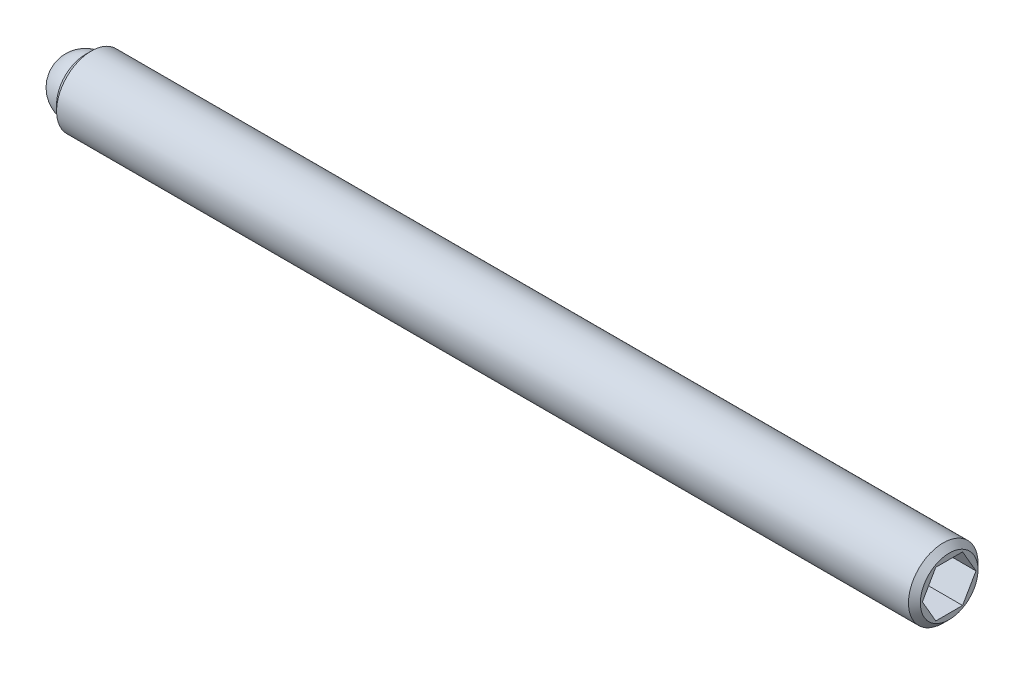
ISO-10303-21;
HEADER;
FILE_DESCRIPTION(('STEP AP214'),'2;1');
FILE_NAME('part.step','',(''),(''),'','','');
FILE_SCHEMA(('AUTOMOTIVE_DESIGN { 1 0 10303 214 1 1 1 1 }'));
ENDSEC;
DATA;
#1=APPLICATION_CONTEXT('core data for automotive mechanical design processes');
#2=APPLICATION_PROTOCOL_DEFINITION('international standard','automotive_design',2000,#1);
#3=PRODUCT_CONTEXT('',#1,'mechanical');
#4=PRODUCT('Part','Part','',(#3));
#5=PRODUCT_RELATED_PRODUCT_CATEGORY('part','',(#4));
#6=PRODUCT_DEFINITION_FORMATION('','',#4);
#7=PRODUCT_DEFINITION_CONTEXT('part definition',#1,'design');
#8=PRODUCT_DEFINITION('design','',#6,#7);
#9=PRODUCT_DEFINITION_SHAPE('','',#8);
#10=(LENGTH_UNIT() NAMED_UNIT(*) SI_UNIT(.MILLI.,.METRE.));
#11=(NAMED_UNIT(*) PLANE_ANGLE_UNIT() SI_UNIT($,.RADIAN.));
#12=(NAMED_UNIT(*) SI_UNIT($,.STERADIAN.) SOLID_ANGLE_UNIT());
#13=UNCERTAINTY_MEASURE_WITH_UNIT(LENGTH_MEASURE(1.E-05),#10,'distance_accuracy_value','');
#14=(GEOMETRIC_REPRESENTATION_CONTEXT(3) GLOBAL_UNCERTAINTY_ASSIGNED_CONTEXT((#13)) GLOBAL_UNIT_ASSIGNED_CONTEXT((#10,
#11,#12)) REPRESENTATION_CONTEXT('',''));
#15=CARTESIAN_POINT('',(0.,0.,0.));
#16=DIRECTION('',(0.,0.,1.));
#17=DIRECTION('',(1.,0.,0.));
#18=AXIS2_PLACEMENT_3D('',#15,#16,#17);
#19=CARTESIAN_POINT('',(0.,0.,0.));
#20=DIRECTION('',(0.,-1.,0.));
#21=DIRECTION('',(0.,0.,-1.));
#22=AXIS2_PLACEMENT_3D('',#19,#20,#21);
#23=SPHERICAL_SURFACE('',#22,1.190625);
#24=CARTESIAN_POINT('',(0.,-1.190625,0.));
#25=VERTEX_POINT('',#24);
#26=VERTEX_LOOP('',#25);
#27=FACE_BOUND('',#26,.T.);
#28=ADVANCED_FACE('F43',(#27),#23,.T.);
#29=CLOSED_SHELL('',(#28));
#30=MANIFOLD_SOLID_BREP('B2',#29);
#31=CARTESIAN_POINT('',(36.909375,0.,0.));
#32=DIRECTION('',(-1.,0.,0.));
#33=DIRECTION('',(0.,0.,1.));
#34=AXIS2_PLACEMENT_3D('',#31,#32,#33);
#35=CYLINDRICAL_SURFACE('',#34,1.4859);
#36=CARTESIAN_POINT('',(36.655375,0.,0.));
#37=DIRECTION('',(1.,0.,0.));
#38=DIRECTION('',(0.,0.,-1.));
#39=AXIS2_PLACEMENT_3D('',#36,#37,#38);
#40=CIRCLE('',#39,1.4859);
#41=CARTESIAN_POINT('',(36.655375,0.,-1.4859));
#42=VERTEX_POINT('',#41);
#43=EDGE_CURVE('E41',#42,#42,#40,.F.);
#44=ORIENTED_EDGE('',*,*,#43,.T.);
#45=EDGE_LOOP('',(#44));
#46=FACE_BOUND('',#45,.T.);
#47=CARTESIAN_POINT('',(0.253999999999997,0.,0.));
#48=DIRECTION('',(1.,0.,0.));
#49=DIRECTION('',(0.,0.,-1.));
#50=AXIS2_PLACEMENT_3D('',#47,#48,#49);
#51=CIRCLE('',#50,1.4859);
#52=CARTESIAN_POINT('',(0.253999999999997,0.,-1.4859));
#53=VERTEX_POINT('',#52);
#54=EDGE_CURVE('E159',#53,#53,#51,.T.);
#55=ORIENTED_EDGE('',*,*,#54,.T.);
#56=EDGE_LOOP('',(#55));
#57=FACE_BOUND('',#56,.T.);
#58=ADVANCED_FACE('F56',(#46,#57),#35,.T.);
#59=CARTESIAN_POINT('',(36.909375,0.,0.));
#60=DIRECTION('',(1.,0.,0.));
#61=DIRECTION('',(0.,0.,-1.));
#62=AXIS2_PLACEMENT_3D('',#59,#60,#61);
#63=PLANE('',#62);
#64=DIRECTION('',(0.,0.866025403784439,-0.5));
#65=VECTOR('',#64,1.);
#66=CARTESIAN_POINT('',(36.909375,-0.992187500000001,-0.572839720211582));
#67=LINE('',#66,#65);
#68=CARTESIAN_POINT('',(36.909375,-0.992187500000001,-0.572839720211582));
#69=VERTEX_POINT('',#68);
#70=CARTESIAN_POINT('',(36.909375,0.,-1.14567944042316));
#71=VERTEX_POINT('',#70);
#72=EDGE_CURVE('E71',#69,#71,#67,.T.);
#73=ORIENTED_EDGE('',*,*,#72,.F.);
#74=DIRECTION('',(0.,0.,-1.));
#75=VECTOR('',#74,1.);
#76=CARTESIAN_POINT('',(36.909375,-0.992187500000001,0.572839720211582));
#77=LINE('',#76,#75);
#78=CARTESIAN_POINT('',(36.909375,-0.992187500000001,0.572839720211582));
#79=VERTEX_POINT('',#78);
#80=EDGE_CURVE('E155',#79,#69,#77,.T.);
#81=ORIENTED_EDGE('',*,*,#80,.F.);
#82=DIRECTION('',(0.,-0.866025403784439,-0.5));
#83=VECTOR('',#82,1.);
#84=CARTESIAN_POINT('',(36.909375,0.,1.14567944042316));
#85=LINE('',#84,#83);
#86=CARTESIAN_POINT('',(36.909375,0.,1.14567944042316));
#87=VERTEX_POINT('',#86);
#88=EDGE_CURVE('E153',#87,#79,#85,.T.);
#89=ORIENTED_EDGE('',*,*,#88,.F.);
#90=DIRECTION('',(0.,-0.866025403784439,0.5));
#91=VECTOR('',#90,1.);
#92=CARTESIAN_POINT('',(36.909375,0.992187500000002,0.572839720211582));
#93=LINE('',#92,#91);
#94=CARTESIAN_POINT('',(36.909375,0.992187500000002,0.572839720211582));
#95=VERTEX_POINT('',#94);
#96=EDGE_CURVE('E119',#95,#87,#93,.T.);
#97=ORIENTED_EDGE('',*,*,#96,.F.);
#98=DIRECTION('',(0.,0.,1.));
#99=VECTOR('',#98,1.);
#100=CARTESIAN_POINT('',(36.909375,0.992187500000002,-0.572839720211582));
#101=LINE('',#100,#99);
#102=CARTESIAN_POINT('',(36.909375,0.992187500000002,-0.572839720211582));
#103=VERTEX_POINT('',#102);
#104=EDGE_CURVE('E149',#103,#95,#101,.T.);
#105=ORIENTED_EDGE('',*,*,#104,.F.);
#106=DIRECTION('',(0.,0.866025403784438,0.5));
#107=VECTOR('',#106,1.);
#108=CARTESIAN_POINT('',(36.909375,0.,-1.14567944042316));
#109=LINE('',#108,#107);
#110=EDGE_CURVE('E145',#71,#103,#109,.T.);
#111=ORIENTED_EDGE('',*,*,#110,.F.);
#112=EDGE_LOOP('',(#73,#81,#89,#97,#105,#111));
#113=FACE_BOUND('',#112,.T.);
#114=CARTESIAN_POINT('',(36.909375,0.,0.));
#115=DIRECTION('',(1.,0.,0.));
#116=DIRECTION('',(0.,0.,-1.));
#117=AXIS2_PLACEMENT_3D('',#114,#115,#116);
#118=CIRCLE('',#117,1.23190000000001);
#119=CARTESIAN_POINT('',(36.909375,0.,-1.23190000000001));
#120=VERTEX_POINT('',#119);
#121=EDGE_CURVE('E64',#120,#120,#118,.T.);
#122=ORIENTED_EDGE('',*,*,#121,.T.);
#123=EDGE_LOOP('',(#122));
#124=FACE_BOUND('',#123,.T.);
#125=ADVANCED_FACE('F172',(#113,#124),#63,.T.);
#126=CARTESIAN_POINT('',(0.,0.,0.));
#127=DIRECTION('',(1.,0.,0.));
#128=DIRECTION('',(0.,0.,-1.));
#129=AXIS2_PLACEMENT_3D('',#126,#127,#128);
#130=PLANE('',#129);
#131=CARTESIAN_POINT('',(0.,0.,0.));
#132=DIRECTION('',(-1.,0.,0.));
#133=DIRECTION('',(0.,0.,1.));
#134=AXIS2_PLACEMENT_3D('',#131,#132,#133);
#135=CIRCLE('',#134,1.190625);
#136=CARTESIAN_POINT('',(0.,0.,1.190625));
#137=VERTEX_POINT('',#136);
#138=EDGE_CURVE('E227',#137,#137,#135,.T.);
#139=ORIENTED_EDGE('',*,*,#138,.F.);
#140=EDGE_LOOP('',(#139));
#141=FACE_BOUND('',#140,.T.);
#142=CARTESIAN_POINT('',(0.,0.,0.));
#143=DIRECTION('',(1.,0.,0.));
#144=DIRECTION('',(0.,0.,-1.));
#145=AXIS2_PLACEMENT_3D('',#142,#143,#144);
#146=CIRCLE('',#145,1.2319);
#147=CARTESIAN_POINT('',(0.,0.,-1.2319));
#148=VERTEX_POINT('',#147);
#149=EDGE_CURVE('E167',#148,#148,#146,.F.);
#150=ORIENTED_EDGE('',*,*,#149,.T.);
#151=EDGE_LOOP('',(#150));
#152=FACE_BOUND('',#151,.T.);
#153=ADVANCED_FACE('F184',(#141,#152),#130,.F.);
#154=CARTESIAN_POINT('',(0.253999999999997,0.,0.));
#155=DIRECTION('',(1.,0.,0.));
#156=DIRECTION('',(0.,0.,-1.));
#157=AXIS2_PLACEMENT_3D('',#154,#155,#156);
#158=CONICAL_SURFACE('',#157,1.4859,0.785398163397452);
#159=ORIENTED_EDGE('',*,*,#149,.F.);
#160=EDGE_LOOP('',(#159));
#161=FACE_BOUND('',#160,.T.);
#162=ORIENTED_EDGE('',*,*,#54,.F.);
#163=EDGE_LOOP('',(#162));
#164=FACE_BOUND('',#163,.T.);
#165=ADVANCED_FACE('F176',(#161,#164),#158,.T.);
#166=CARTESIAN_POINT('',(36.909375,0.,0.));
#167=DIRECTION('',(-1.,0.,0.));
#168=DIRECTION('',(0.,0.,1.));
#169=AXIS2_PLACEMENT_3D('',#166,#167,#168);
#170=CONICAL_SURFACE('',#169,1.23190000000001,0.785398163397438);
#171=ORIENTED_EDGE('',*,*,#43,.F.);
#172=EDGE_LOOP('',(#171));
#173=FACE_BOUND('',#172,.T.);
#174=ORIENTED_EDGE('',*,*,#121,.F.);
#175=EDGE_LOOP('',(#174));
#176=FACE_BOUND('',#175,.T.);
#177=ADVANCED_FACE('F58',(#173,#176),#170,.T.);
#178=CARTESIAN_POINT('',(34.623375,-0.992187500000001,-0.572839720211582));
#179=DIRECTION('',(0.,-0.5,-0.866025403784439));
#180=DIRECTION('',(0.,0.866025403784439,-0.5));
#181=AXIS2_PLACEMENT_3D('',#178,#179,#180);
#182=PLANE('',#181);
#183=ORIENTED_EDGE('',*,*,#72,.T.);
#184=DIRECTION('',(1.,0.,0.));
#185=VECTOR('',#184,1.);
#186=CARTESIAN_POINT('',(34.623375,0.,-1.14567944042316));
#187=LINE('',#186,#185);
#188=CARTESIAN_POINT('',(34.623375,0.,-1.14567944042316));
#189=VERTEX_POINT('',#188);
#190=EDGE_CURVE('E101',#189,#71,#187,.T.);
#191=ORIENTED_EDGE('',*,*,#190,.F.);
#192=DIRECTION('',(0.,0.866025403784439,-0.5));
#193=VECTOR('',#192,1.);
#194=CARTESIAN_POINT('',(34.623375,-0.992187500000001,-0.572839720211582));
#195=LINE('',#194,#193);
#196=CARTESIAN_POINT('',(34.623375,-0.992187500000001,-0.572839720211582));
#197=VERTEX_POINT('',#196);
#198=EDGE_CURVE('E157',#197,#189,#195,.T.);
#199=ORIENTED_EDGE('',*,*,#198,.F.);
#200=DIRECTION('',(1.,0.,0.));
#201=VECTOR('',#200,1.);
#202=CARTESIAN_POINT('',(34.623375,-0.992187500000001,-0.572839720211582));
#203=LINE('',#202,#201);
#204=EDGE_CURVE('E79',#197,#69,#203,.T.);
#205=ORIENTED_EDGE('',*,*,#204,.T.);
#206=EDGE_LOOP('',(#183,#191,#199,#205));
#207=FACE_BOUND('',#206,.T.);
#208=ADVANCED_FACE('F175',(#207),#182,.F.);
#209=CARTESIAN_POINT('',(34.623375,-0.992187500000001,0.572839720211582));
#210=DIRECTION('',(0.,-1.,0.));
#211=DIRECTION('',(0.,0.,-1.));
#212=AXIS2_PLACEMENT_3D('',#209,#210,#211);
#213=PLANE('',#212);
#214=ORIENTED_EDGE('',*,*,#80,.T.);
#215=ORIENTED_EDGE('',*,*,#204,.F.);
#216=DIRECTION('',(0.,0.,-1.));
#217=VECTOR('',#216,1.);
#218=CARTESIAN_POINT('',(34.623375,-0.992187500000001,0.572839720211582));
#219=LINE('',#218,#217);
#220=CARTESIAN_POINT('',(34.623375,-0.992187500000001,0.572839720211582));
#221=VERTEX_POINT('',#220);
#222=EDGE_CURVE('E131',#221,#197,#219,.T.);
#223=ORIENTED_EDGE('',*,*,#222,.F.);
#224=DIRECTION('',(1.,0.,0.));
#225=VECTOR('',#224,1.);
#226=CARTESIAN_POINT('',(34.623375,-0.992187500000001,0.572839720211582));
#227=LINE('',#226,#225);
#228=EDGE_CURVE('E123',#221,#79,#227,.T.);
#229=ORIENTED_EDGE('',*,*,#228,.T.);
#230=EDGE_LOOP('',(#214,#215,#223,#229));
#231=FACE_BOUND('',#230,.T.);
#232=ADVANCED_FACE('F182',(#231),#213,.F.);
#233=CARTESIAN_POINT('',(34.623375,0.,1.14567944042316));
#234=DIRECTION('',(0.,-0.5,0.866025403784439));
#235=DIRECTION('',(0.,-0.866025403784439,-0.5));
#236=AXIS2_PLACEMENT_3D('',#233,#234,#235);
#237=PLANE('',#236);
#238=ORIENTED_EDGE('',*,*,#88,.T.);
#239=ORIENTED_EDGE('',*,*,#228,.F.);
#240=DIRECTION('',(0.,-0.866025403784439,-0.5));
#241=VECTOR('',#240,1.);
#242=CARTESIAN_POINT('',(34.623375,0.,1.14567944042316));
#243=LINE('',#242,#241);
#244=CARTESIAN_POINT('',(34.623375,0.,1.14567944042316));
#245=VERTEX_POINT('',#244);
#246=EDGE_CURVE('E127',#245,#221,#243,.T.);
#247=ORIENTED_EDGE('',*,*,#246,.F.);
#248=DIRECTION('',(1.,0.,0.));
#249=VECTOR('',#248,1.);
#250=CARTESIAN_POINT('',(34.623375,0.,1.14567944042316));
#251=LINE('',#250,#249);
#252=EDGE_CURVE('E112',#245,#87,#251,.T.);
#253=ORIENTED_EDGE('',*,*,#252,.T.);
#254=EDGE_LOOP('',(#238,#239,#247,#253));
#255=FACE_BOUND('',#254,.T.);
#256=ADVANCED_FACE('F128',(#255),#237,.F.);
#257=CARTESIAN_POINT('',(34.623375,0.992187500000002,0.572839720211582));
#258=DIRECTION('',(0.,0.5,0.866025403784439));
#259=DIRECTION('',(0.,-0.866025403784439,0.5));
#260=AXIS2_PLACEMENT_3D('',#257,#258,#259);
#261=PLANE('',#260);
#262=ORIENTED_EDGE('',*,*,#96,.T.);
#263=ORIENTED_EDGE('',*,*,#252,.F.);
#264=DIRECTION('',(0.,-0.866025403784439,0.5));
#265=VECTOR('',#264,1.);
#266=CARTESIAN_POINT('',(34.623375,0.992187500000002,0.572839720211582));
#267=LINE('',#266,#265);
#268=CARTESIAN_POINT('',(34.623375,0.992187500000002,0.572839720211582));
#269=VERTEX_POINT('',#268);
#270=EDGE_CURVE('E116',#269,#245,#267,.T.);
#271=ORIENTED_EDGE('',*,*,#270,.F.);
#272=DIRECTION('',(1.,0.,0.));
#273=VECTOR('',#272,1.);
#274=CARTESIAN_POINT('',(34.623375,0.992187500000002,0.572839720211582));
#275=LINE('',#274,#273);
#276=EDGE_CURVE('E124',#269,#95,#275,.T.);
#277=ORIENTED_EDGE('',*,*,#276,.T.);
#278=EDGE_LOOP('',(#262,#263,#271,#277));
#279=FACE_BOUND('',#278,.T.);
#280=ADVANCED_FACE('F114',(#279),#261,.F.);
#281=CARTESIAN_POINT('',(34.623375,0.992187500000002,-0.572839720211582));
#282=DIRECTION('',(0.,1.,0.));
#283=DIRECTION('',(0.,0.,1.));
#284=AXIS2_PLACEMENT_3D('',#281,#282,#283);
#285=PLANE('',#284);
#286=ORIENTED_EDGE('',*,*,#104,.T.);
#287=ORIENTED_EDGE('',*,*,#276,.F.);
#288=DIRECTION('',(0.,0.,1.));
#289=VECTOR('',#288,1.);
#290=CARTESIAN_POINT('',(34.623375,0.992187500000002,-0.572839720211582));
#291=LINE('',#290,#289);
#292=CARTESIAN_POINT('',(34.623375,0.992187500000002,-0.572839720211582));
#293=VERTEX_POINT('',#292);
#294=EDGE_CURVE('E137',#293,#269,#291,.T.);
#295=ORIENTED_EDGE('',*,*,#294,.F.);
#296=DIRECTION('',(1.,0.,0.));
#297=VECTOR('',#296,1.);
#298=CARTESIAN_POINT('',(34.623375,0.992187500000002,-0.572839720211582));
#299=LINE('',#298,#297);
#300=EDGE_CURVE('E162',#293,#103,#299,.T.);
#301=ORIENTED_EDGE('',*,*,#300,.T.);
#302=EDGE_LOOP('',(#286,#287,#295,#301));
#303=FACE_BOUND('',#302,.T.);
#304=ADVANCED_FACE('F203',(#303),#285,.F.);
#305=CARTESIAN_POINT('',(34.623375,0.,-1.14567944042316));
#306=DIRECTION('',(0.,0.5,-0.866025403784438));
#307=DIRECTION('',(0.,0.866025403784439,0.5));
#308=AXIS2_PLACEMENT_3D('',#305,#306,#307);
#309=PLANE('',#308);
#310=ORIENTED_EDGE('',*,*,#110,.T.);
#311=ORIENTED_EDGE('',*,*,#300,.F.);
#312=DIRECTION('',(0.,0.866025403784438,0.5));
#313=VECTOR('',#312,1.);
#314=CARTESIAN_POINT('',(34.623375,0.,-1.14567944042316));
#315=LINE('',#314,#313);
#316=EDGE_CURVE('E139',#189,#293,#315,.T.);
#317=ORIENTED_EDGE('',*,*,#316,.F.);
#318=ORIENTED_EDGE('',*,*,#190,.T.);
#319=EDGE_LOOP('',(#310,#311,#317,#318));
#320=FACE_BOUND('',#319,.T.);
#321=ADVANCED_FACE('F200',(#320),#309,.F.);
#322=CARTESIAN_POINT('',(34.623375,0.,0.));
#323=DIRECTION('',(1.,0.,0.));
#324=DIRECTION('',(0.,0.,-1.));
#325=AXIS2_PLACEMENT_3D('',#322,#323,#324);
#326=PLANE('',#325);
#327=ORIENTED_EDGE('',*,*,#198,.T.);
#328=ORIENTED_EDGE('',*,*,#316,.T.);
#329=ORIENTED_EDGE('',*,*,#294,.T.);
#330=ORIENTED_EDGE('',*,*,#270,.T.);
#331=ORIENTED_EDGE('',*,*,#246,.T.);
#332=ORIENTED_EDGE('',*,*,#222,.T.);
#333=EDGE_LOOP('',(#327,#328,#329,#330,#331,#332));
#334=FACE_BOUND('',#333,.T.);
#335=ADVANCED_FACE('F134',(#334),#326,.T.);
#336=CARTESIAN_POINT('',(1.190625,0.,0.));
#337=DIRECTION('',(-1.,0.,0.));
#338=DIRECTION('',(0.,0.,1.));
#339=AXIS2_PLACEMENT_3D('',#336,#337,#338);
#340=CYLINDRICAL_SURFACE('',#339,1.190625);
#341=CARTESIAN_POINT('',(1.190625,0.,0.));
#342=DIRECTION('',(-1.,0.,0.));
#343=DIRECTION('',(0.,0.,1.));
#344=AXIS2_PLACEMENT_3D('',#341,#342,#343);
#345=CIRCLE('',#344,1.190625);
#346=CARTESIAN_POINT('',(1.190625,0.,1.190625));
#347=VERTEX_POINT('',#346);
#348=EDGE_CURVE('E146',#347,#347,#345,.T.);
#349=CARTESIAN_POINT('',(1.190625,0.,1.190625));
#350=CARTESIAN_POINT('',(1.17822265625,0.,1.190625));
#351=CARTESIAN_POINT('',(1.1658203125,0.,1.190625));
#352=CARTESIAN_POINT('',(1.141015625,0.,1.190625));
#353=CARTESIAN_POINT('',(1.12861328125,0.,1.190625));
#354=CARTESIAN_POINT('',(1.10380859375,0.,1.190625));
#355=CARTESIAN_POINT('',(1.09140625,0.,1.190625));
#356=CARTESIAN_POINT('',(1.0666015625,0.,1.190625));
#357=CARTESIAN_POINT('',(1.05419921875,0.,1.190625));
#358=CARTESIAN_POINT('',(1.02939453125,0.,1.190625));
#359=CARTESIAN_POINT('',(1.0169921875,0.,1.190625));
#360=CARTESIAN_POINT('',(0.9921875,0.,1.190625));
#361=CARTESIAN_POINT('',(0.97978515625,0.,1.190625));
#362=CARTESIAN_POINT('',(0.95498046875,0.,1.190625));
#363=CARTESIAN_POINT('',(0.942578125,0.,1.190625));
#364=CARTESIAN_POINT('',(0.9177734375,0.,1.190625));
#365=CARTESIAN_POINT('',(0.90537109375,0.,1.190625));
#366=CARTESIAN_POINT('',(0.88056640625,0.,1.190625));
#367=CARTESIAN_POINT('',(0.8681640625,0.,1.190625));
#368=CARTESIAN_POINT('',(0.843359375,0.,1.190625));
#369=CARTESIAN_POINT('',(0.83095703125,0.,1.190625));
#370=CARTESIAN_POINT('',(0.80615234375,0.,1.190625));
#371=CARTESIAN_POINT('',(0.79375,0.,1.190625));
#372=CARTESIAN_POINT('',(0.7689453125,0.,1.190625));
#373=CARTESIAN_POINT('',(0.75654296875,0.,1.190625));
#374=CARTESIAN_POINT('',(0.73173828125,0.,1.190625));
#375=CARTESIAN_POINT('',(0.7193359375,0.,1.190625));
#376=CARTESIAN_POINT('',(0.69453125,0.,1.190625));
#377=CARTESIAN_POINT('',(0.68212890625,0.,1.190625));
#378=CARTESIAN_POINT('',(0.65732421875,0.,1.190625));
#379=CARTESIAN_POINT('',(0.644921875,0.,1.190625));
#380=CARTESIAN_POINT('',(0.6201171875,0.,1.190625));
#381=CARTESIAN_POINT('',(0.60771484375,0.,1.190625));
#382=CARTESIAN_POINT('',(0.58291015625,0.,1.190625));
#383=CARTESIAN_POINT('',(0.5705078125,0.,1.190625));
#384=CARTESIAN_POINT('',(0.545703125,0.,1.190625));
#385=CARTESIAN_POINT('',(0.53330078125,0.,1.190625));
#386=CARTESIAN_POINT('',(0.50849609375,0.,1.190625));
#387=CARTESIAN_POINT('',(0.49609375,0.,1.190625));
#388=CARTESIAN_POINT('',(0.4712890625,0.,1.190625));
#389=CARTESIAN_POINT('',(0.45888671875,0.,1.190625));
#390=CARTESIAN_POINT('',(0.43408203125,0.,1.190625));
#391=CARTESIAN_POINT('',(0.4216796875,0.,1.190625));
#392=CARTESIAN_POINT('',(0.396875,0.,1.190625));
#393=CARTESIAN_POINT('',(0.38447265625,0.,1.190625));
#394=CARTESIAN_POINT('',(0.35966796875,0.,1.190625));
#395=CARTESIAN_POINT('',(0.347265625,0.,1.190625));
#396=CARTESIAN_POINT('',(0.3224609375,0.,1.190625));
#397=CARTESIAN_POINT('',(0.31005859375,0.,1.190625));
#398=CARTESIAN_POINT('',(0.28525390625,0.,1.190625));
#399=CARTESIAN_POINT('',(0.2728515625,0.,1.190625));
#400=CARTESIAN_POINT('',(0.248046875,0.,1.190625));
#401=CARTESIAN_POINT('',(0.23564453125,0.,1.190625));
#402=CARTESIAN_POINT('',(0.21083984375,0.,1.190625));
#403=CARTESIAN_POINT('',(0.1984375,0.,1.190625));
#404=CARTESIAN_POINT('',(0.1736328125,0.,1.190625));
#405=CARTESIAN_POINT('',(0.16123046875,0.,1.190625));
#406=CARTESIAN_POINT('',(0.13642578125,0.,1.190625));
#407=CARTESIAN_POINT('',(0.1240234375,0.,1.190625));
#408=CARTESIAN_POINT('',(0.0992187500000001,0.,1.190625));
#409=CARTESIAN_POINT('',(0.08681640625,0.,1.190625));
#410=CARTESIAN_POINT('',(0.06201171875,0.,1.190625));
#411=CARTESIAN_POINT('',(0.049609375,0.,1.190625));
#412=CARTESIAN_POINT('',(0.0248046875,0.,1.190625));
#413=CARTESIAN_POINT('',(0.01240234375,0.,1.190625));
#414=CARTESIAN_POINT('',(0.,0.,1.190625));
#415=B_SPLINE_CURVE_WITH_KNOTS('',3,(#349,#350,#351,#352,#353,#354,#355,#356,#357,#358,#359,
#360,#361,#362,#363,#364,#365,#366,#367,#368,#369,#370,#371,#372,#373,#374,#375,#376,#377,#378,
#379,#380,#381,#382,#383,#384,#385,#386,#387,#388,#389,#390,#391,#392,#393,#394,#395,#396,#397,
#398,#399,#400,#401,#402,#403,#404,#405,#406,#407,#408,#409,#410,#411,#412,#413,#414),
.UNSPECIFIED.,.F.,.F.,(4,2,2,2,2,2,2,2,2,2,2,2,2,2,2,2,2,2,2,2,2,2,2,2,2,2,2,2,2,2,2,2,4),(0.,
0.03720703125,0.0744140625,0.11162109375,0.148828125,0.18603515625,0.2232421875,0.26044921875,
0.29765625,0.33486328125,0.3720703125,0.40927734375,0.446484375,0.48369140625,0.5208984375,
0.55810546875,0.5953125,0.63251953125,0.6697265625,0.70693359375,0.744140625,0.78134765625,
0.8185546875,0.85576171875,0.89296875,0.93017578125,0.9673828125,1.00458984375,1.041796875,
1.07900390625,1.1162109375,1.15341796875,1.190625),.UNSPECIFIED.);
#416=EDGE_CURVE('BSEAM216',#347,#137,#415,.T.);
#417=ORIENTED_EDGE('',*,*,#348,.F.);
#418=ORIENTED_EDGE('',*,*,#138,.T.);
#419=ORIENTED_EDGE('',*,*,#416,.T.);
#420=ORIENTED_EDGE('',*,*,#416,.F.);
#421=EDGE_LOOP('',(#417,#419,#418,#420));
#422=FACE_BOUND('',#421,.T.);
#423=ADVANCED_FACE('F216',(#422),#340,.F.);
#424=CARTESIAN_POINT('',(1.190625,0.,0.));
#425=DIRECTION('',(-1.,0.,0.));
#426=DIRECTION('',(0.,0.,1.));
#427=AXIS2_PLACEMENT_3D('',#424,#425,#426);
#428=PLANE('',#427);
#429=ORIENTED_EDGE('',*,*,#348,.T.);
#430=EDGE_LOOP('',(#429));
#431=FACE_BOUND('',#430,.T.);
#432=ADVANCED_FACE('F219',(#431),#428,.T.);
#433=CLOSED_SHELL('',(#58,#125,#153,#165,#177,#208,#232,#256,#280,#304,#321,#335,#423,#432));
#434=MANIFOLD_SOLID_BREP('B6',#433);
#435=ADVANCED_BREP_SHAPE_REPRESENTATION('',(#18,#30,#434),#14);
#436=SHAPE_DEFINITION_REPRESENTATION(#9,#435);
ENDSEC;
END-ISO-10303-21;
